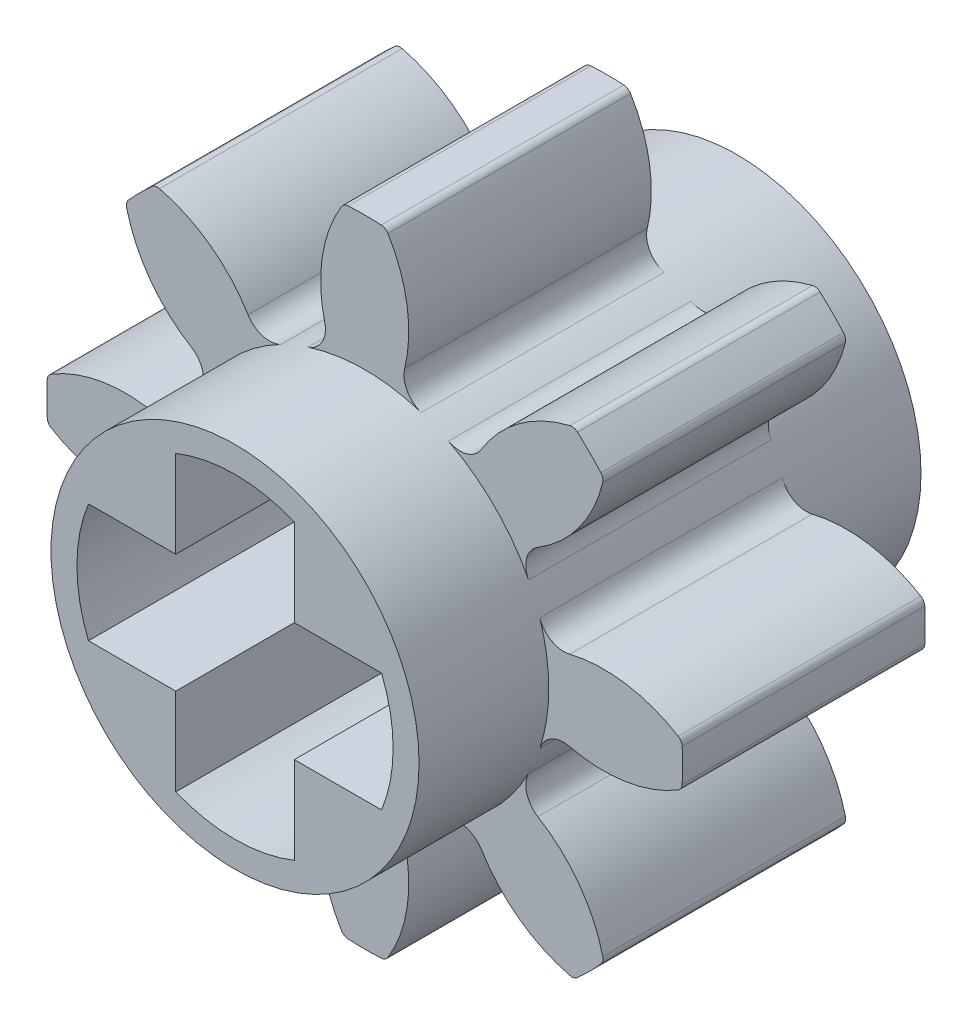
from build123d import *

# Parameters (mm, degrees)
SKETCH1_R                = 2.794
BASE_EXTRUDE_DEPTH       = 3.81
BOSS_EXTRUDE1_DEPTH      = 1.8415
FILLET1_R                = 0.127
FILLET2_R                = 0.381
CIRPATTERN2_COUNT        = 8
FILLET1_OF_CIRPATTERN2_R = 0.127
FILLET2_OF_CIRPATTERN2_R = 0.381
CUT_EXTRUDE1_DEPTH       = 11.229611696


with BuildPart() as part:
    # Sketch1 → Base-Extrude (new, symmetric)
    with BuildSketch(Plane.XY):
        with Locations(Location((0, 0, 0), (0, 0, 180))):
            Circle(SKETCH1_R)
    extrude(amount=BASE_EXTRUDE_DEPTH, both=True)

    # Sketch2 → Boss-Extrude1 (add, symmetric)
    with BuildSketch(Plane.XY):
        with BuildLine():
            ThreePointArc((0.485173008, 2.751552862), (0.661924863, 3.80471821), (0.3175, 4.815544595))
            ThreePointArc((0.3175, 4.815544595), (0, 4.826), (-0.3175, 4.815544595))
            ThreePointArc((-0.3175, 4.815544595), (-0.661924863, 3.80471821), (-0.485173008, 2.751552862))
            ThreePointArc((-0.485173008, 2.751552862), (0, 2.794), (0.485173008, 2.751552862))
        make_face()
    boss_extrude1 = extrude(amount=BOSS_EXTRUDE1_DEPTH, both=True)

    # Fillet1
    fillet1_edges = [part.edges().sort_by_distance(p)[0] for p in [
        (0.3175, 4.815544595, 0),
        (-0.3175, 4.815544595, 0),
    ]]
    fillet(fillet1_edges, radius=FILLET1_R)

    # Fillet2
    fillet2_edges = [part.edges().sort_by_distance(p)[0] for p in [
        (-0.485173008, 2.751552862, 0),
        (0.485173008, 2.751552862, 0),
    ]]
    fillet(fillet2_edges, radius=FILLET2_R)

    # CirPattern2: Boss-Extrude1 ×8 about axis
    cirpattern2_axis = Axis((0, 0, 0), (0, 0, 1))
    for i in range(1, CIRPATTERN2_COUNT):
        add(boss_extrude1.rotate(cirpattern2_axis, i * 360 / CIRPATTERN2_COUNT))

    # Fillet1 of CirPattern2
    fillet1_of_cirpattern2_edges = [part.edges().sort_by_distance(p)[0] for p in [
        (-3.180597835, 3.629610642, 0),
        (-3.629610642, 3.180597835, 0),
        (-4.815544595, 0.3175, 0),
        (-4.815544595, -0.3175, 0),
        (-3.629610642, -3.180597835, 0),
        (-3.180597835, -3.629610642, 0),
        (-0.3175, -4.815544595, 0),
        (0.3175, -4.815544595, 0),
        (3.180597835, -3.629610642, 0),
        (3.629610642, -3.180597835, 0),
        (4.815544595, -0.3175, 0),
        (4.815544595, 0.3175, 0),
        (3.629610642, 3.180597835, 0),
        (3.180597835, 3.629610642, 0),
    ]]
    fillet(fillet1_of_cirpattern2_edges, radius=FILLET1_OF_CIRPATTERN2_R)

    # Fillet2 of CirPattern2
    fillet2_of_cirpattern2_edges = [part.edges().sort_by_distance(p)[0] for p in [
        (-2.288710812, 1.602572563, 0),
        (-1.602572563, 2.288710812, 0),
        (-2.751552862, -0.485173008, 0),
        (-2.751552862, 0.485173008, 0),
        (-1.602572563, -2.288710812, 0),
        (-2.288710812, -1.602572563, 0),
        (0.485173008, -2.751552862, 0),
        (-0.485173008, -2.751552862, 0),
        (2.288710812, -1.602572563, 0),
        (1.602572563, -2.288710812, 0),
        (2.751552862, 0.485173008, 0),
        (2.751552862, -0.485173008, 0),
        (1.602572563, 2.288710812, 0),
        (2.288710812, 1.602572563, 0),
    ]]
    fillet(fillet2_of_cirpattern2_edges, radius=FILLET2_OF_CIRPATTERN2_R)

    # Sketch3 → Cut-Extrude1 (cut, through all)
    with BuildSketch(Plane.XY.offset(3.81)):
        with BuildLine():
            Line((-2.224859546, 0.9), (-0.9, 0.9))
            Line((-0.9, 0.9), (-0.9, 2.224859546))
            ThreePointArc((-0.9, 2.224859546), (0, 2.4), (0.9, 2.224859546))
            Line((0.9, 2.224859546), (0.9, 0.9))
            Line((0.9, 0.9), (2.224859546, 0.9))
            ThreePointArc((2.224859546, 0.9), (2.4, 0), (2.224859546, -0.9))
            Line((2.224859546, -0.9), (0.9, -0.9))
            Line((0.9, -0.9), (0.9, -2.224859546))
            ThreePointArc((0.9, -2.224859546), (0, -2.4), (-0.9, -2.224859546))
            Line((-0.9, -2.224859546), (-0.9, -0.9))
            Line((-0.9, -0.9), (-2.224859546, -0.9))
            ThreePointArc((-2.224859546, -0.9), (-2.4, 0), (-2.224859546, 0.9))
        make_face()
    extrude(amount=-CUT_EXTRUDE1_DEPTH, mode=Mode.SUBTRACT)


solid = part.part
